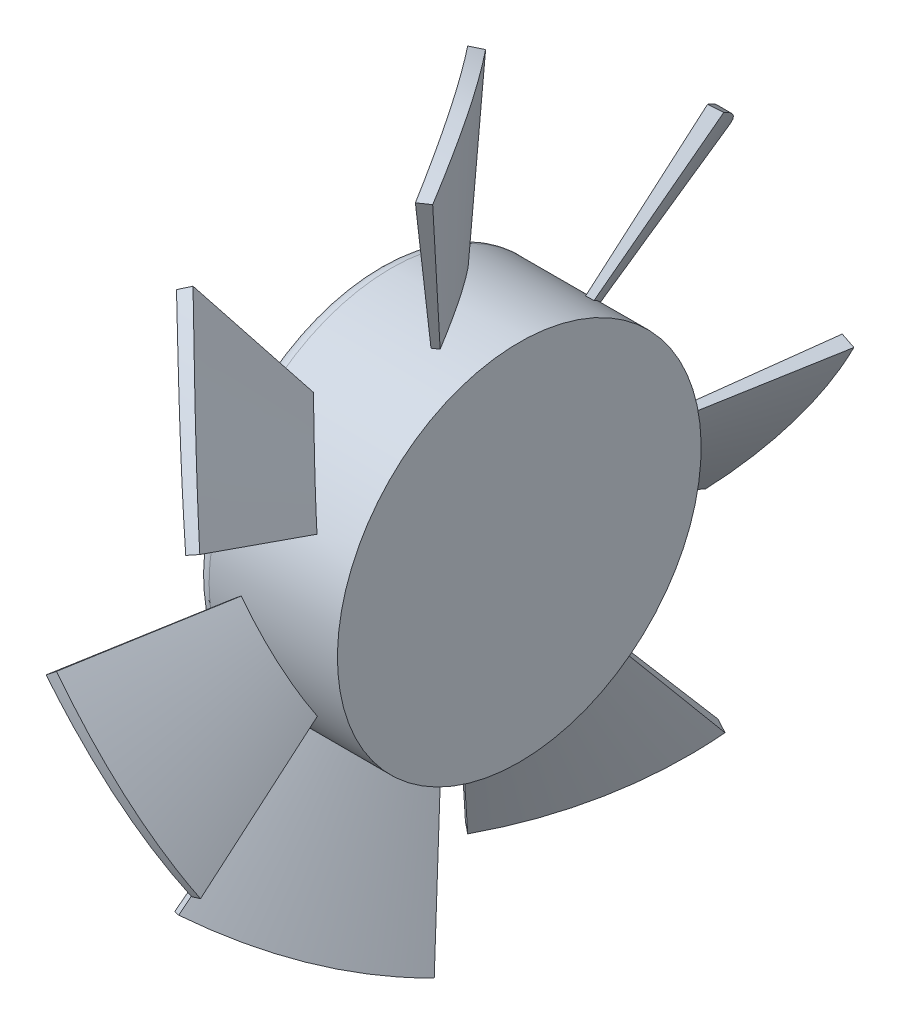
from build123d import *

# Parameters (mm, degrees)
CIRPATTERN1_COUNT          = 7
SKETCH_CUT_BLADE_OUTSIDE_W = 139.508
SKETCH_CUT_BLADE_OUTSIDE_H = 136.907
SKETCH_CUT_BLADE_OUTSIDE_R = 52
CUT_FAN_BLADE_DEPTH        = 80.344787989
COSMETIC_FILLET_R          = 2


with BuildPart() as part:
    # Sketch5 → Body (revolve)
    with BuildSketch(Plane.XY, mode=Mode.PRIVATE) as body_sk:
        Polygon((-25.4, 27.5), (-4, 27.5), (-4, 0), (-25.151093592, 0), (-25.151093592, 7.127746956), (-25.4, 7.127746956), align=None)
    revolve(body_sk.sketch.rotate(Axis((-25.151093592, 0, 0), (1, 0, 0)), 180), axis=Axis((-25.151093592, 0, 0), (1, 0, 0)))

    # Sketch-Blade-Top → Loft-Fan-Blade section 0
    with BuildSketch(Plane(origin=(0, 52, 0), x_dir=(-1, 0, 0), z_dir=(0, 1, 0)), mode=Mode.PRIVATE) as loft_fan_blade_s0:
        with BuildLine():
            Line((6.928566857, 12.933836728), (5.162671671, 11.994893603))
            ThreePointArc((5.162671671, 11.994893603), (13.041924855, -1.118385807), (22.24872561, -13.336223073))
            Line((22.24872561, -13.336223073), (23.780814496, -12.050647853))
            ThreePointArc((23.780814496, -12.050647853), (14.7, 0), (6.928566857, 12.933836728))
        make_face()
    loft_fan_blade = loft([loft_fan_blade_s0.sketch, Vertex(-14.7, 0, 0)])

    # CirPattern1: Loft-Fan-Blade ×7 about axis
    cirpattern1_axis = Axis((-25.151093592, 0, 0), (1, 0, 0))
    for i in range(1, CIRPATTERN1_COUNT):
        add(loft_fan_blade.rotate(cirpattern1_axis, i * 360 / CIRPATTERN1_COUNT))

    # Sketch-Cut-Blade outside → Cut-Fan-Blade (cut, through all)
    with BuildSketch(Plane(origin=(0, 0, 0), x_dir=(0, 0, -1), z_dir=(1, 0, 0))):
        with Locations((-0.045, -0.3185)):
            Rectangle(SKETCH_CUT_BLADE_OUTSIDE_W, SKETCH_CUT_BLADE_OUTSIDE_H)
        Circle(SKETCH_CUT_BLADE_OUTSIDE_R, mode=Mode.SUBTRACT)
    extrude(amount=-CUT_FAN_BLADE_DEPTH, mode=Mode.SUBTRACT)

    # Cosmetic-Fillet
    cosmetic_fillet_edges = [part.edges().sort_by_distance(p)[0] for p in [
        (-25.4, 27.5, 0),
    ]]
    fillet(cosmetic_fillet_edges, radius=COSMETIC_FILLET_R)


solid = part.part
